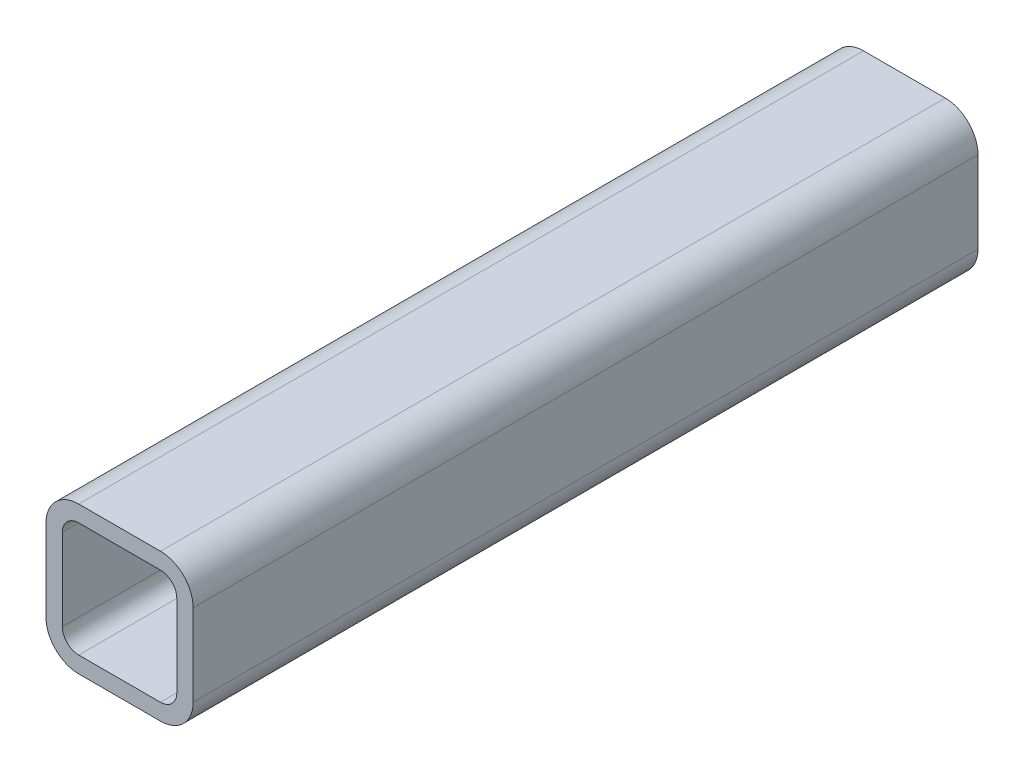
ISO-10303-21;
HEADER;
FILE_DESCRIPTION(('STEP AP214'),'2;1');
FILE_NAME('part.step','',(''),(''),'','','');
FILE_SCHEMA(('AUTOMOTIVE_DESIGN { 1 0 10303 214 1 1 1 1 }'));
ENDSEC;
DATA;
#1=APPLICATION_CONTEXT('core data for automotive mechanical design processes');
#2=APPLICATION_PROTOCOL_DEFINITION('international standard','automotive_design',2000,#1);
#3=PRODUCT_CONTEXT('',#1,'mechanical');
#4=PRODUCT('Part','Part','',(#3));
#5=PRODUCT_RELATED_PRODUCT_CATEGORY('part','',(#4));
#6=PRODUCT_DEFINITION_FORMATION('','',#4);
#7=PRODUCT_DEFINITION_CONTEXT('part definition',#1,'design');
#8=PRODUCT_DEFINITION('design','',#6,#7);
#9=PRODUCT_DEFINITION_SHAPE('','',#8);
#10=(LENGTH_UNIT() NAMED_UNIT(*) SI_UNIT(.MILLI.,.METRE.));
#11=(NAMED_UNIT(*) PLANE_ANGLE_UNIT() SI_UNIT($,.RADIAN.));
#12=(NAMED_UNIT(*) SI_UNIT($,.STERADIAN.) SOLID_ANGLE_UNIT());
#13=UNCERTAINTY_MEASURE_WITH_UNIT(LENGTH_MEASURE(1.E-05),#10,'distance_accuracy_value','');
#14=(GEOMETRIC_REPRESENTATION_CONTEXT(3) GLOBAL_UNCERTAINTY_ASSIGNED_CONTEXT((#13)) GLOBAL_UNIT_ASSIGNED_CONTEXT((#10,
#11,#12)) REPRESENTATION_CONTEXT('',''));
#15=CARTESIAN_POINT('',(0.,0.,0.));
#16=DIRECTION('',(0.,0.,1.));
#17=DIRECTION('',(1.,0.,0.));
#18=AXIS2_PLACEMENT_3D('',#15,#16,#17);
#19=CARTESIAN_POINT('',(12.8280542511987,45.9140005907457,304.8));
#20=DIRECTION('',(0.,0.,1.));
#21=DIRECTION('',(1.,0.,0.));
#22=AXIS2_PLACEMENT_3D('',#19,#20,#21);
#23=PLANE('',#22);
#24=CARTESIAN_POINT('',(12.8280542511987,45.9140005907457,304.8));
#25=DIRECTION('',(0.,0.,1.));
#26=DIRECTION('',(1.,0.,0.));
#27=AXIS2_PLACEMENT_3D('',#24,#25,#26);
#28=CIRCLE('',#27,12.7);
#29=CARTESIAN_POINT('',(12.8280542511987,58.6140005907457,304.8));
#30=VERTEX_POINT('',#29);
#31=CARTESIAN_POINT('',(0.128054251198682,45.9140005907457,304.8));
#32=VERTEX_POINT('',#31);
#33=EDGE_CURVE('E211',#30,#32,#28,.T.);
#34=ORIENTED_EDGE('',*,*,#33,.T.);
#35=DIRECTION('',(0.,-1.,0.));
#36=VECTOR('',#35,1.);
#37=CARTESIAN_POINT('',(0.128054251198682,14.1640005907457,304.8));
#38=LINE('',#37,#36);
#39=CARTESIAN_POINT('',(0.128054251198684,14.1640005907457,304.8));
#40=VERTEX_POINT('',#39);
#41=EDGE_CURVE('E214',#32,#40,#38,.T.);
#42=ORIENTED_EDGE('',*,*,#41,.T.);
#43=CARTESIAN_POINT('',(12.8280542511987,14.1640005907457,304.8));
#44=DIRECTION('',(0.,0.,1.));
#45=DIRECTION('',(1.,0.,0.));
#46=AXIS2_PLACEMENT_3D('',#43,#44,#45);
#47=CIRCLE('',#46,12.7);
#48=CARTESIAN_POINT('',(12.8280542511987,1.46400059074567,304.8));
#49=VERTEX_POINT('',#48);
#50=EDGE_CURVE('E217',#40,#49,#47,.T.);
#51=ORIENTED_EDGE('',*,*,#50,.T.);
#52=DIRECTION('',(1.,0.,0.));
#53=VECTOR('',#52,1.);
#54=CARTESIAN_POINT('',(44.5780542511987,1.46400059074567,304.8));
#55=LINE('',#54,#53);
#56=CARTESIAN_POINT('',(44.5780542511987,1.46400059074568,304.8));
#57=VERTEX_POINT('',#56);
#58=EDGE_CURVE('E219',#49,#57,#55,.T.);
#59=ORIENTED_EDGE('',*,*,#58,.T.);
#60=CARTESIAN_POINT('',(44.5780542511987,14.1640005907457,304.8));
#61=DIRECTION('',(0.,0.,1.));
#62=DIRECTION('',(1.,0.,0.));
#63=AXIS2_PLACEMENT_3D('',#60,#61,#62);
#64=CIRCLE('',#63,12.7);
#65=CARTESIAN_POINT('',(57.2780542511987,14.1640005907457,304.8));
#66=VERTEX_POINT('',#65);
#67=EDGE_CURVE('E221',#57,#66,#64,.T.);
#68=ORIENTED_EDGE('',*,*,#67,.T.);
#69=DIRECTION('',(0.,1.,0.));
#70=VECTOR('',#69,1.);
#71=CARTESIAN_POINT('',(57.2780542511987,45.9140005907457,304.8));
#72=LINE('',#71,#70);
#73=CARTESIAN_POINT('',(57.2780542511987,45.9140005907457,304.8));
#74=VERTEX_POINT('',#73);
#75=EDGE_CURVE('E223',#66,#74,#72,.T.);
#76=ORIENTED_EDGE('',*,*,#75,.T.);
#77=CARTESIAN_POINT('',(44.5780542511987,45.9140005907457,304.8));
#78=DIRECTION('',(0.,0.,1.));
#79=DIRECTION('',(1.,0.,0.));
#80=AXIS2_PLACEMENT_3D('',#77,#78,#79);
#81=CIRCLE('',#80,12.7);
#82=CARTESIAN_POINT('',(44.5780542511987,58.6140005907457,304.8));
#83=VERTEX_POINT('',#82);
#84=EDGE_CURVE('E225',#74,#83,#81,.T.);
#85=ORIENTED_EDGE('',*,*,#84,.T.);
#86=DIRECTION('',(-1.,0.,0.));
#87=VECTOR('',#86,1.);
#88=CARTESIAN_POINT('',(12.8280542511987,58.6140005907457,304.8));
#89=LINE('',#88,#87);
#90=EDGE_CURVE('E227',#83,#30,#89,.T.);
#91=ORIENTED_EDGE('',*,*,#90,.T.);
#92=EDGE_LOOP('',(#34,#42,#51,#59,#68,#76,#85,#91));
#93=FACE_BOUND('',#92,.T.);
#94=DIRECTION('',(0.,-1.,0.));
#95=VECTOR('',#94,1.);
#96=CARTESIAN_POINT('',(6.47805425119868,14.1640005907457,304.8));
#97=LINE('',#96,#95);
#98=CARTESIAN_POINT('',(6.47805425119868,45.9140005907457,304.8));
#99=VERTEX_POINT('',#98);
#100=CARTESIAN_POINT('',(6.47805425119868,14.1640005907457,304.8));
#101=VERTEX_POINT('',#100);
#102=EDGE_CURVE('E154',#99,#101,#97,.T.);
#103=ORIENTED_EDGE('',*,*,#102,.F.);
#104=CARTESIAN_POINT('',(12.8280542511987,45.9140005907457,304.8));
#105=DIRECTION('',(0.,0.,1.));
#106=DIRECTION('',(1.,0.,0.));
#107=AXIS2_PLACEMENT_3D('',#104,#105,#106);
#108=CIRCLE('',#107,6.35);
#109=CARTESIAN_POINT('',(12.8280542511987,52.2640005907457,304.8));
#110=VERTEX_POINT('',#109);
#111=EDGE_CURVE('E146',#110,#99,#108,.T.);
#112=ORIENTED_EDGE('',*,*,#111,.F.);
#113=DIRECTION('',(-1.,0.,0.));
#114=VECTOR('',#113,1.);
#115=CARTESIAN_POINT('',(12.8280542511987,52.2640005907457,304.8));
#116=LINE('',#115,#114);
#117=CARTESIAN_POINT('',(44.5780542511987,52.2640005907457,304.8));
#118=VERTEX_POINT('',#117);
#119=EDGE_CURVE('E179',#118,#110,#116,.T.);
#120=ORIENTED_EDGE('',*,*,#119,.F.);
#121=CARTESIAN_POINT('',(44.5780542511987,45.9140005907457,304.8));
#122=DIRECTION('',(0.,0.,1.));
#123=DIRECTION('',(1.,0.,0.));
#124=AXIS2_PLACEMENT_3D('',#121,#122,#123);
#125=CIRCLE('',#124,6.35);
#126=CARTESIAN_POINT('',(50.9280542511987,45.9140005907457,304.8));
#127=VERTEX_POINT('',#126);
#128=EDGE_CURVE('E177',#127,#118,#125,.T.);
#129=ORIENTED_EDGE('',*,*,#128,.F.);
#130=DIRECTION('',(0.,1.,0.));
#131=VECTOR('',#130,1.);
#132=CARTESIAN_POINT('',(50.9280542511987,45.9140005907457,304.8));
#133=LINE('',#132,#131);
#134=CARTESIAN_POINT('',(50.9280542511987,14.1640005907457,304.8));
#135=VERTEX_POINT('',#134);
#136=EDGE_CURVE('E175',#135,#127,#133,.T.);
#137=ORIENTED_EDGE('',*,*,#136,.F.);
#138=CARTESIAN_POINT('',(44.5780542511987,14.1640005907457,304.8));
#139=DIRECTION('',(0.,0.,1.));
#140=DIRECTION('',(1.,0.,0.));
#141=AXIS2_PLACEMENT_3D('',#138,#139,#140);
#142=CIRCLE('',#141,6.35);
#143=CARTESIAN_POINT('',(44.5780542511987,7.81400059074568,304.8));
#144=VERTEX_POINT('',#143);
#145=EDGE_CURVE('E173',#144,#135,#142,.T.);
#146=ORIENTED_EDGE('',*,*,#145,.F.);
#147=DIRECTION('',(1.,0.,0.));
#148=VECTOR('',#147,1.);
#149=CARTESIAN_POINT('',(44.5780542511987,7.81400059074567,304.8));
#150=LINE('',#149,#148);
#151=CARTESIAN_POINT('',(12.8280542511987,7.81400059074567,304.8));
#152=VERTEX_POINT('',#151);
#153=EDGE_CURVE('E169',#152,#144,#150,.T.);
#154=ORIENTED_EDGE('',*,*,#153,.F.);
#155=CARTESIAN_POINT('',(12.8280542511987,14.1640005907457,304.8));
#156=DIRECTION('',(0.,0.,1.));
#157=DIRECTION('',(1.,0.,0.));
#158=AXIS2_PLACEMENT_3D('',#155,#156,#157);
#159=CIRCLE('',#158,6.35);
#160=EDGE_CURVE('E167',#101,#152,#159,.T.);
#161=ORIENTED_EDGE('',*,*,#160,.F.);
#162=EDGE_LOOP('',(#103,#112,#120,#129,#137,#146,#154,#161));
#163=FACE_BOUND('',#162,.T.);
#164=ADVANCED_FACE('F33',(#93,#163),#23,.T.);
#165=CARTESIAN_POINT('',(12.8280542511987,45.9140005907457,0.));
#166=DIRECTION('',(0.,0.,1.));
#167=DIRECTION('',(1.,0.,0.));
#168=AXIS2_PLACEMENT_3D('',#165,#166,#167);
#169=PLANE('',#168);
#170=CARTESIAN_POINT('',(12.8280542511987,45.9140005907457,0.));
#171=DIRECTION('',(0.,0.,1.));
#172=DIRECTION('',(1.,0.,0.));
#173=AXIS2_PLACEMENT_3D('',#170,#171,#172);
#174=CIRCLE('',#173,12.7);
#175=CARTESIAN_POINT('',(12.8280542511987,58.6140005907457,0.));
#176=VERTEX_POINT('',#175);
#177=CARTESIAN_POINT('',(0.128054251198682,45.9140005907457,0.));
#178=VERTEX_POINT('',#177);
#179=EDGE_CURVE('E162',#176,#178,#174,.T.);
#180=ORIENTED_EDGE('',*,*,#179,.F.);
#181=DIRECTION('',(-1.,0.,0.));
#182=VECTOR('',#181,1.);
#183=CARTESIAN_POINT('',(12.8280542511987,58.6140005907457,0.));
#184=LINE('',#183,#182);
#185=CARTESIAN_POINT('',(44.5780542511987,58.6140005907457,0.));
#186=VERTEX_POINT('',#185);
#187=EDGE_CURVE('E215',#186,#176,#184,.T.);
#188=ORIENTED_EDGE('',*,*,#187,.F.);
#189=CARTESIAN_POINT('',(44.5780542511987,45.9140005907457,0.));
#190=DIRECTION('',(0.,0.,1.));
#191=DIRECTION('',(1.,0.,0.));
#192=AXIS2_PLACEMENT_3D('',#189,#190,#191);
#193=CIRCLE('',#192,12.7);
#194=CARTESIAN_POINT('',(57.2780542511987,45.9140005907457,0.));
#195=VERTEX_POINT('',#194);
#196=EDGE_CURVE('E242',#195,#186,#193,.T.);
#197=ORIENTED_EDGE('',*,*,#196,.F.);
#198=DIRECTION('',(0.,1.,0.));
#199=VECTOR('',#198,1.);
#200=CARTESIAN_POINT('',(57.2780542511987,45.9140005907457,0.));
#201=LINE('',#200,#199);
#202=CARTESIAN_POINT('',(57.2780542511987,14.1640005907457,0.));
#203=VERTEX_POINT('',#202);
#204=EDGE_CURVE('E240',#203,#195,#201,.T.);
#205=ORIENTED_EDGE('',*,*,#204,.F.);
#206=CARTESIAN_POINT('',(44.5780542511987,14.1640005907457,0.));
#207=DIRECTION('',(0.,0.,1.));
#208=DIRECTION('',(1.,0.,0.));
#209=AXIS2_PLACEMENT_3D('',#206,#207,#208);
#210=CIRCLE('',#209,12.7);
#211=CARTESIAN_POINT('',(44.5780542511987,1.46400059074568,0.));
#212=VERTEX_POINT('',#211);
#213=EDGE_CURVE('E238',#212,#203,#210,.T.);
#214=ORIENTED_EDGE('',*,*,#213,.F.);
#215=DIRECTION('',(1.,0.,0.));
#216=VECTOR('',#215,1.);
#217=CARTESIAN_POINT('',(44.5780542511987,1.46400059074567,0.));
#218=LINE('',#217,#216);
#219=CARTESIAN_POINT('',(12.8280542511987,1.46400059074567,0.));
#220=VERTEX_POINT('',#219);
#221=EDGE_CURVE('E236',#220,#212,#218,.T.);
#222=ORIENTED_EDGE('',*,*,#221,.F.);
#223=CARTESIAN_POINT('',(12.8280542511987,14.1640005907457,0.));
#224=DIRECTION('',(0.,0.,1.));
#225=DIRECTION('',(1.,0.,0.));
#226=AXIS2_PLACEMENT_3D('',#223,#224,#225);
#227=CIRCLE('',#226,12.7);
#228=CARTESIAN_POINT('',(0.128054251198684,14.1640005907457,0.));
#229=VERTEX_POINT('',#228);
#230=EDGE_CURVE('E234',#229,#220,#227,.T.);
#231=ORIENTED_EDGE('',*,*,#230,.F.);
#232=DIRECTION('',(0.,-1.,0.));
#233=VECTOR('',#232,1.);
#234=CARTESIAN_POINT('',(0.128054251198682,14.1640005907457,0.));
#235=LINE('',#234,#233);
#236=EDGE_CURVE('E232',#178,#229,#235,.T.);
#237=ORIENTED_EDGE('',*,*,#236,.F.);
#238=EDGE_LOOP('',(#180,#188,#197,#205,#214,#222,#231,#237));
#239=FACE_BOUND('',#238,.T.);
#240=CARTESIAN_POINT('',(12.8280542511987,45.9140005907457,0.));
#241=DIRECTION('',(0.,0.,1.));
#242=DIRECTION('',(1.,0.,0.));
#243=AXIS2_PLACEMENT_3D('',#240,#241,#242);
#244=CIRCLE('',#243,6.35);
#245=CARTESIAN_POINT('',(12.8280542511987,52.2640005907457,0.));
#246=VERTEX_POINT('',#245);
#247=CARTESIAN_POINT('',(6.47805425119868,45.9140005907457,0.));
#248=VERTEX_POINT('',#247);
#249=EDGE_CURVE('E56',#246,#248,#244,.T.);
#250=ORIENTED_EDGE('',*,*,#249,.T.);
#251=DIRECTION('',(0.,-1.,0.));
#252=VECTOR('',#251,1.);
#253=CARTESIAN_POINT('',(6.47805425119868,14.1640005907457,0.));
#254=LINE('',#253,#252);
#255=CARTESIAN_POINT('',(6.47805425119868,14.1640005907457,0.));
#256=VERTEX_POINT('',#255);
#257=EDGE_CURVE('E161',#248,#256,#254,.T.);
#258=ORIENTED_EDGE('',*,*,#257,.T.);
#259=CARTESIAN_POINT('',(12.8280542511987,14.1640005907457,0.));
#260=DIRECTION('',(0.,0.,1.));
#261=DIRECTION('',(1.,0.,0.));
#262=AXIS2_PLACEMENT_3D('',#259,#260,#261);
#263=CIRCLE('',#262,6.35);
#264=CARTESIAN_POINT('',(12.8280542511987,7.81400059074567,0.));
#265=VERTEX_POINT('',#264);
#266=EDGE_CURVE('E183',#256,#265,#263,.T.);
#267=ORIENTED_EDGE('',*,*,#266,.T.);
#268=DIRECTION('',(1.,0.,0.));
#269=VECTOR('',#268,1.);
#270=CARTESIAN_POINT('',(44.5780542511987,7.81400059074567,0.));
#271=LINE('',#270,#269);
#272=CARTESIAN_POINT('',(44.5780542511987,7.81400059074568,0.));
#273=VERTEX_POINT('',#272);
#274=EDGE_CURVE('E186',#265,#273,#271,.T.);
#275=ORIENTED_EDGE('',*,*,#274,.T.);
#276=CARTESIAN_POINT('',(44.5780542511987,14.1640005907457,0.));
#277=DIRECTION('',(0.,0.,1.));
#278=DIRECTION('',(1.,0.,0.));
#279=AXIS2_PLACEMENT_3D('',#276,#277,#278);
#280=CIRCLE('',#279,6.35);
#281=CARTESIAN_POINT('',(50.9280542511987,14.1640005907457,0.));
#282=VERTEX_POINT('',#281);
#283=EDGE_CURVE('E189',#273,#282,#280,.T.);
#284=ORIENTED_EDGE('',*,*,#283,.T.);
#285=DIRECTION('',(0.,1.,0.));
#286=VECTOR('',#285,1.);
#287=CARTESIAN_POINT('',(50.9280542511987,45.9140005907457,0.));
#288=LINE('',#287,#286);
#289=CARTESIAN_POINT('',(50.9280542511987,45.9140005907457,0.));
#290=VERTEX_POINT('',#289);
#291=EDGE_CURVE('E192',#282,#290,#288,.T.);
#292=ORIENTED_EDGE('',*,*,#291,.T.);
#293=CARTESIAN_POINT('',(44.5780542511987,45.9140005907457,0.));
#294=DIRECTION('',(0.,0.,1.));
#295=DIRECTION('',(1.,0.,0.));
#296=AXIS2_PLACEMENT_3D('',#293,#294,#295);
#297=CIRCLE('',#296,6.35);
#298=CARTESIAN_POINT('',(44.5780542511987,52.2640005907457,0.));
#299=VERTEX_POINT('',#298);
#300=EDGE_CURVE('E195',#290,#299,#297,.T.);
#301=ORIENTED_EDGE('',*,*,#300,.T.);
#302=DIRECTION('',(-1.,0.,0.));
#303=VECTOR('',#302,1.);
#304=CARTESIAN_POINT('',(12.8280542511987,52.2640005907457,0.));
#305=LINE('',#304,#303);
#306=EDGE_CURVE('E155',#299,#246,#305,.T.);
#307=ORIENTED_EDGE('',*,*,#306,.T.);
#308=EDGE_LOOP('',(#250,#258,#267,#275,#284,#292,#301,#307));
#309=FACE_BOUND('',#308,.T.);
#310=ADVANCED_FACE('F272',(#239,#309),#169,.F.);
#311=CARTESIAN_POINT('',(12.8280542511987,45.9140005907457,304.8));
#312=DIRECTION('',(0.,0.,-1.));
#313=DIRECTION('',(-1.,0.,0.));
#314=AXIS2_PLACEMENT_3D('',#311,#312,#313);
#315=CYLINDRICAL_SURFACE('',#314,12.7);
#316=ORIENTED_EDGE('',*,*,#179,.T.);
#317=DIRECTION('',(0.,0.,-1.));
#318=VECTOR('',#317,1.);
#319=CARTESIAN_POINT('',(0.128054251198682,45.9140005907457,304.8));
#320=LINE('',#319,#318);
#321=EDGE_CURVE('E11',#32,#178,#320,.T.);
#322=ORIENTED_EDGE('',*,*,#321,.F.);
#323=ORIENTED_EDGE('',*,*,#33,.F.);
#324=DIRECTION('',(0.,0.,-1.));
#325=VECTOR('',#324,1.);
#326=CARTESIAN_POINT('',(12.8280542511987,58.6140005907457,304.8));
#327=LINE('',#326,#325);
#328=EDGE_CURVE('E229',#30,#176,#327,.T.);
#329=ORIENTED_EDGE('',*,*,#328,.T.);
#330=EDGE_LOOP('',(#316,#322,#323,#329));
#331=FACE_BOUND('',#330,.T.);
#332=ADVANCED_FACE('F35',(#331),#315,.T.);
#333=CARTESIAN_POINT('',(0.128054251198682,14.1640005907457,304.8));
#334=DIRECTION('',(1.,0.,0.));
#335=DIRECTION('',(0.,0.,-1.));
#336=AXIS2_PLACEMENT_3D('',#333,#334,#335);
#337=PLANE('',#336);
#338=ORIENTED_EDGE('',*,*,#236,.T.);
#339=DIRECTION('',(0.,0.,-1.));
#340=VECTOR('',#339,1.);
#341=CARTESIAN_POINT('',(0.128054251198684,14.1640005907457,304.8));
#342=LINE('',#341,#340);
#343=EDGE_CURVE('E41',#40,#229,#342,.T.);
#344=ORIENTED_EDGE('',*,*,#343,.F.);
#345=ORIENTED_EDGE('',*,*,#41,.F.);
#346=ORIENTED_EDGE('',*,*,#321,.T.);
#347=EDGE_LOOP('',(#338,#344,#345,#346));
#348=FACE_BOUND('',#347,.T.);
#349=ADVANCED_FACE('F289',(#348),#337,.F.);
#350=CARTESIAN_POINT('',(12.8280542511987,14.1640005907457,304.8));
#351=DIRECTION('',(0.,0.,-1.));
#352=DIRECTION('',(-1.,0.,0.));
#353=AXIS2_PLACEMENT_3D('',#350,#351,#352);
#354=CYLINDRICAL_SURFACE('',#353,12.7);
#355=ORIENTED_EDGE('',*,*,#230,.T.);
#356=DIRECTION('',(0.,0.,-1.));
#357=VECTOR('',#356,1.);
#358=CARTESIAN_POINT('',(12.8280542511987,1.46400059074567,304.8));
#359=LINE('',#358,#357);
#360=EDGE_CURVE('E259',#49,#220,#359,.T.);
#361=ORIENTED_EDGE('',*,*,#360,.F.);
#362=ORIENTED_EDGE('',*,*,#50,.F.);
#363=ORIENTED_EDGE('',*,*,#343,.T.);
#364=EDGE_LOOP('',(#355,#361,#362,#363));
#365=FACE_BOUND('',#364,.T.);
#366=ADVANCED_FACE('F266',(#365),#354,.T.);
#367=CARTESIAN_POINT('',(44.5780542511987,1.46400059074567,304.8));
#368=DIRECTION('',(0.,1.,0.));
#369=DIRECTION('',(0.,0.,1.));
#370=AXIS2_PLACEMENT_3D('',#367,#368,#369);
#371=PLANE('',#370);
#372=ORIENTED_EDGE('',*,*,#221,.T.);
#373=DIRECTION('',(0.,0.,-1.));
#374=VECTOR('',#373,1.);
#375=CARTESIAN_POINT('',(44.5780542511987,1.46400059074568,304.8));
#376=LINE('',#375,#374);
#377=EDGE_CURVE('E256',#57,#212,#376,.T.);
#378=ORIENTED_EDGE('',*,*,#377,.F.);
#379=ORIENTED_EDGE('',*,*,#58,.F.);
#380=ORIENTED_EDGE('',*,*,#360,.T.);
#381=EDGE_LOOP('',(#372,#378,#379,#380));
#382=FACE_BOUND('',#381,.T.);
#383=ADVANCED_FACE('F278',(#382),#371,.F.);
#384=CARTESIAN_POINT('',(44.5780542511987,14.1640005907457,304.8));
#385=DIRECTION('',(0.,0.,-1.));
#386=DIRECTION('',(-1.,0.,0.));
#387=AXIS2_PLACEMENT_3D('',#384,#385,#386);
#388=CYLINDRICAL_SURFACE('',#387,12.7);
#389=ORIENTED_EDGE('',*,*,#213,.T.);
#390=DIRECTION('',(0.,0.,-1.));
#391=VECTOR('',#390,1.);
#392=CARTESIAN_POINT('',(57.2780542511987,14.1640005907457,304.8));
#393=LINE('',#392,#391);
#394=EDGE_CURVE('E253',#66,#203,#393,.T.);
#395=ORIENTED_EDGE('',*,*,#394,.F.);
#396=ORIENTED_EDGE('',*,*,#67,.F.);
#397=ORIENTED_EDGE('',*,*,#377,.T.);
#398=EDGE_LOOP('',(#389,#395,#396,#397));
#399=FACE_BOUND('',#398,.T.);
#400=ADVANCED_FACE('F282',(#399),#388,.T.);
#401=CARTESIAN_POINT('',(57.2780542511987,45.9140005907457,304.8));
#402=DIRECTION('',(-1.,0.,0.));
#403=DIRECTION('',(0.,0.,1.));
#404=AXIS2_PLACEMENT_3D('',#401,#402,#403);
#405=PLANE('',#404);
#406=ORIENTED_EDGE('',*,*,#204,.T.);
#407=DIRECTION('',(0.,0.,-1.));
#408=VECTOR('',#407,1.);
#409=CARTESIAN_POINT('',(57.2780542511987,45.9140005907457,304.8));
#410=LINE('',#409,#408);
#411=EDGE_CURVE('E250',#74,#195,#410,.T.);
#412=ORIENTED_EDGE('',*,*,#411,.F.);
#413=ORIENTED_EDGE('',*,*,#75,.F.);
#414=ORIENTED_EDGE('',*,*,#394,.T.);
#415=EDGE_LOOP('',(#406,#412,#413,#414));
#416=FACE_BOUND('',#415,.T.);
#417=ADVANCED_FACE('F302',(#416),#405,.F.);
#418=CARTESIAN_POINT('',(44.5780542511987,45.9140005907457,304.8));
#419=DIRECTION('',(0.,0.,-1.));
#420=DIRECTION('',(-1.,0.,0.));
#421=AXIS2_PLACEMENT_3D('',#418,#419,#420);
#422=CYLINDRICAL_SURFACE('',#421,12.7);
#423=ORIENTED_EDGE('',*,*,#196,.T.);
#424=DIRECTION('',(0.,0.,-1.));
#425=VECTOR('',#424,1.);
#426=CARTESIAN_POINT('',(44.5780542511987,58.6140005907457,304.8));
#427=LINE('',#426,#425);
#428=EDGE_CURVE('E247',#83,#186,#427,.T.);
#429=ORIENTED_EDGE('',*,*,#428,.F.);
#430=ORIENTED_EDGE('',*,*,#84,.F.);
#431=ORIENTED_EDGE('',*,*,#411,.T.);
#432=EDGE_LOOP('',(#423,#429,#430,#431));
#433=FACE_BOUND('',#432,.T.);
#434=ADVANCED_FACE('F300',(#433),#422,.T.);
#435=CARTESIAN_POINT('',(12.8280542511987,58.6140005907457,304.8));
#436=DIRECTION('',(0.,-1.,0.));
#437=DIRECTION('',(0.,0.,-1.));
#438=AXIS2_PLACEMENT_3D('',#435,#436,#437);
#439=PLANE('',#438);
#440=ORIENTED_EDGE('',*,*,#187,.T.);
#441=ORIENTED_EDGE('',*,*,#328,.F.);
#442=ORIENTED_EDGE('',*,*,#90,.F.);
#443=ORIENTED_EDGE('',*,*,#428,.T.);
#444=EDGE_LOOP('',(#440,#441,#442,#443));
#445=FACE_BOUND('',#444,.T.);
#446=ADVANCED_FACE('F295',(#445),#439,.F.);
#447=CARTESIAN_POINT('',(12.8280542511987,45.9140005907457,304.8));
#448=DIRECTION('',(0.,0.,-1.));
#449=DIRECTION('',(-1.,0.,0.));
#450=AXIS2_PLACEMENT_3D('',#447,#448,#449);
#451=CYLINDRICAL_SURFACE('',#450,6.35);
#452=ORIENTED_EDGE('',*,*,#249,.F.);
#453=DIRECTION('',(0.,0.,-1.));
#454=VECTOR('',#453,1.);
#455=CARTESIAN_POINT('',(12.8280542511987,52.2640005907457,304.8));
#456=LINE('',#455,#454);
#457=EDGE_CURVE('E150',#110,#246,#456,.T.);
#458=ORIENTED_EDGE('',*,*,#457,.F.);
#459=ORIENTED_EDGE('',*,*,#111,.T.);
#460=DIRECTION('',(0.,0.,-1.));
#461=VECTOR('',#460,1.);
#462=CARTESIAN_POINT('',(6.47805425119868,45.9140005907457,304.8));
#463=LINE('',#462,#461);
#464=EDGE_CURVE('E149',#99,#248,#463,.T.);
#465=ORIENTED_EDGE('',*,*,#464,.T.);
#466=EDGE_LOOP('',(#452,#458,#459,#465));
#467=FACE_BOUND('',#466,.T.);
#468=ADVANCED_FACE('F148',(#467),#451,.F.);
#469=CARTESIAN_POINT('',(6.47805425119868,14.1640005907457,304.8));
#470=DIRECTION('',(1.,0.,0.));
#471=DIRECTION('',(0.,0.,-1.));
#472=AXIS2_PLACEMENT_3D('',#469,#470,#471);
#473=PLANE('',#472);
#474=ORIENTED_EDGE('',*,*,#257,.F.);
#475=ORIENTED_EDGE('',*,*,#464,.F.);
#476=ORIENTED_EDGE('',*,*,#102,.T.);
#477=DIRECTION('',(0.,0.,-1.));
#478=VECTOR('',#477,1.);
#479=CARTESIAN_POINT('',(6.47805425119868,14.1640005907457,304.8));
#480=LINE('',#479,#478);
#481=EDGE_CURVE('E163',#101,#256,#480,.T.);
#482=ORIENTED_EDGE('',*,*,#481,.T.);
#483=EDGE_LOOP('',(#474,#475,#476,#482));
#484=FACE_BOUND('',#483,.T.);
#485=ADVANCED_FACE('F158',(#484),#473,.T.);
#486=CARTESIAN_POINT('',(12.8280542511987,14.1640005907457,304.8));
#487=DIRECTION('',(0.,0.,-1.));
#488=DIRECTION('',(-1.,0.,0.));
#489=AXIS2_PLACEMENT_3D('',#486,#487,#488);
#490=CYLINDRICAL_SURFACE('',#489,6.35);
#491=ORIENTED_EDGE('',*,*,#266,.F.);
#492=ORIENTED_EDGE('',*,*,#481,.F.);
#493=ORIENTED_EDGE('',*,*,#160,.T.);
#494=DIRECTION('',(0.,0.,-1.));
#495=VECTOR('',#494,1.);
#496=CARTESIAN_POINT('',(12.8280542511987,7.81400059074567,304.8));
#497=LINE('',#496,#495);
#498=EDGE_CURVE('E208',#152,#265,#497,.T.);
#499=ORIENTED_EDGE('',*,*,#498,.T.);
#500=EDGE_LOOP('',(#491,#492,#493,#499));
#501=FACE_BOUND('',#500,.T.);
#502=ADVANCED_FACE('F327',(#501),#490,.F.);
#503=CARTESIAN_POINT('',(44.5780542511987,7.81400059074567,304.8));
#504=DIRECTION('',(0.,1.,0.));
#505=DIRECTION('',(0.,0.,1.));
#506=AXIS2_PLACEMENT_3D('',#503,#504,#505);
#507=PLANE('',#506);
#508=ORIENTED_EDGE('',*,*,#274,.F.);
#509=ORIENTED_EDGE('',*,*,#498,.F.);
#510=ORIENTED_EDGE('',*,*,#153,.T.);
#511=DIRECTION('',(0.,0.,-1.));
#512=VECTOR('',#511,1.);
#513=CARTESIAN_POINT('',(44.5780542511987,7.81400059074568,304.8));
#514=LINE('',#513,#512);
#515=EDGE_CURVE('E206',#144,#273,#514,.T.);
#516=ORIENTED_EDGE('',*,*,#515,.T.);
#517=EDGE_LOOP('',(#508,#509,#510,#516));
#518=FACE_BOUND('',#517,.T.);
#519=ADVANCED_FACE('F331',(#518),#507,.T.);
#520=CARTESIAN_POINT('',(44.5780542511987,14.1640005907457,304.8));
#521=DIRECTION('',(0.,0.,-1.));
#522=DIRECTION('',(-1.,0.,0.));
#523=AXIS2_PLACEMENT_3D('',#520,#521,#522);
#524=CYLINDRICAL_SURFACE('',#523,6.35);
#525=ORIENTED_EDGE('',*,*,#283,.F.);
#526=ORIENTED_EDGE('',*,*,#515,.F.);
#527=ORIENTED_EDGE('',*,*,#145,.T.);
#528=DIRECTION('',(0.,0.,-1.));
#529=VECTOR('',#528,1.);
#530=CARTESIAN_POINT('',(50.9280542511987,14.1640005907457,304.8));
#531=LINE('',#530,#529);
#532=EDGE_CURVE('E204',#135,#282,#531,.T.);
#533=ORIENTED_EDGE('',*,*,#532,.T.);
#534=EDGE_LOOP('',(#525,#526,#527,#533));
#535=FACE_BOUND('',#534,.T.);
#536=ADVANCED_FACE('F337',(#535),#524,.F.);
#537=CARTESIAN_POINT('',(50.9280542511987,45.9140005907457,304.8));
#538=DIRECTION('',(-1.,0.,0.));
#539=DIRECTION('',(0.,0.,1.));
#540=AXIS2_PLACEMENT_3D('',#537,#538,#539);
#541=PLANE('',#540);
#542=ORIENTED_EDGE('',*,*,#291,.F.);
#543=ORIENTED_EDGE('',*,*,#532,.F.);
#544=ORIENTED_EDGE('',*,*,#136,.T.);
#545=DIRECTION('',(0.,0.,-1.));
#546=VECTOR('',#545,1.);
#547=CARTESIAN_POINT('',(50.9280542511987,45.9140005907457,304.8));
#548=LINE('',#547,#546);
#549=EDGE_CURVE('E202',#127,#290,#548,.T.);
#550=ORIENTED_EDGE('',*,*,#549,.T.);
#551=EDGE_LOOP('',(#542,#543,#544,#550));
#552=FACE_BOUND('',#551,.T.);
#553=ADVANCED_FACE('F341',(#552),#541,.T.);
#554=CARTESIAN_POINT('',(44.5780542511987,45.9140005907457,304.8));
#555=DIRECTION('',(0.,0.,-1.));
#556=DIRECTION('',(-1.,0.,0.));
#557=AXIS2_PLACEMENT_3D('',#554,#555,#556);
#558=CYLINDRICAL_SURFACE('',#557,6.35);
#559=ORIENTED_EDGE('',*,*,#300,.F.);
#560=ORIENTED_EDGE('',*,*,#549,.F.);
#561=ORIENTED_EDGE('',*,*,#128,.T.);
#562=DIRECTION('',(0.,0.,-1.));
#563=VECTOR('',#562,1.);
#564=CARTESIAN_POINT('',(44.5780542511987,52.2640005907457,304.8));
#565=LINE('',#564,#563);
#566=EDGE_CURVE('E48',#118,#299,#565,.T.);
#567=ORIENTED_EDGE('',*,*,#566,.T.);
#568=EDGE_LOOP('',(#559,#560,#561,#567));
#569=FACE_BOUND('',#568,.T.);
#570=ADVANCED_FACE('F345',(#569),#558,.F.);
#571=CARTESIAN_POINT('',(12.8280542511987,52.2640005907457,304.8));
#572=DIRECTION('',(0.,-1.,0.));
#573=DIRECTION('',(0.,0.,-1.));
#574=AXIS2_PLACEMENT_3D('',#571,#572,#573);
#575=PLANE('',#574);
#576=ORIENTED_EDGE('',*,*,#306,.F.);
#577=ORIENTED_EDGE('',*,*,#566,.F.);
#578=ORIENTED_EDGE('',*,*,#119,.T.);
#579=ORIENTED_EDGE('',*,*,#457,.T.);
#580=EDGE_LOOP('',(#576,#577,#578,#579));
#581=FACE_BOUND('',#580,.T.);
#582=ADVANCED_FACE('F349',(#581),#575,.T.);
#583=CLOSED_SHELL('',(#164,#310,#332,#349,#366,#383,#400,#417,#434,#446,#468,#485,#502,#519,
#536,#553,#570,#582));
#584=MANIFOLD_SOLID_BREP('B2',#583);
#585=ADVANCED_BREP_SHAPE_REPRESENTATION('',(#18,#584),#14);
#586=SHAPE_DEFINITION_REPRESENTATION(#9,#585);
ENDSEC;
END-ISO-10303-21;
